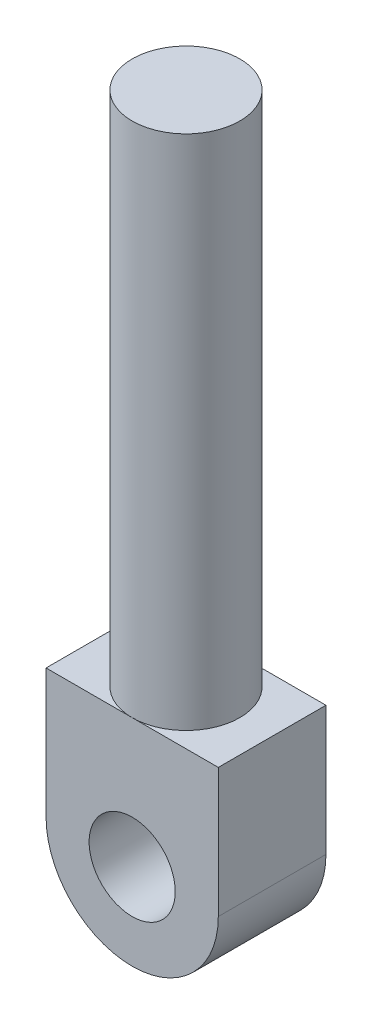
ISO-10303-21;
HEADER;
FILE_DESCRIPTION(('STEP AP214'),'2;1');
FILE_NAME('part.step','',(''),(''),'','','');
FILE_SCHEMA(('AUTOMOTIVE_DESIGN { 1 0 10303 214 1 1 1 1 }'));
ENDSEC;
DATA;
#1=APPLICATION_CONTEXT('core data for automotive mechanical design processes');
#2=APPLICATION_PROTOCOL_DEFINITION('international standard','automotive_design',2000,#1);
#3=PRODUCT_CONTEXT('',#1,'mechanical');
#4=PRODUCT('Part','Part','',(#3));
#5=PRODUCT_RELATED_PRODUCT_CATEGORY('part','',(#4));
#6=PRODUCT_DEFINITION_FORMATION('','',#4);
#7=PRODUCT_DEFINITION_CONTEXT('part definition',#1,'design');
#8=PRODUCT_DEFINITION('design','',#6,#7);
#9=PRODUCT_DEFINITION_SHAPE('','',#8);
#10=(LENGTH_UNIT() NAMED_UNIT(*) SI_UNIT(.MILLI.,.METRE.));
#11=(NAMED_UNIT(*) PLANE_ANGLE_UNIT() SI_UNIT($,.RADIAN.));
#12=(NAMED_UNIT(*) SI_UNIT($,.STERADIAN.) SOLID_ANGLE_UNIT());
#13=UNCERTAINTY_MEASURE_WITH_UNIT(LENGTH_MEASURE(1.E-05),#10,'distance_accuracy_value','');
#14=(GEOMETRIC_REPRESENTATION_CONTEXT(3) GLOBAL_UNCERTAINTY_ASSIGNED_CONTEXT((#13)) GLOBAL_UNIT_ASSIGNED_CONTEXT((#10,
#11,#12)) REPRESENTATION_CONTEXT('',''));
#15=CARTESIAN_POINT('',(0.,0.,0.));
#16=DIRECTION('',(0.,0.,1.));
#17=DIRECTION('',(1.,0.,0.));
#18=AXIS2_PLACEMENT_3D('',#15,#16,#17);
#19=CARTESIAN_POINT('',(0.,60.,0.));
#20=DIRECTION('',(0.,-1.,0.));
#21=DIRECTION('',(0.,0.,-1.));
#22=AXIS2_PLACEMENT_3D('',#19,#20,#21);
#23=CYLINDRICAL_SURFACE('',#22,6.25);
#24=CARTESIAN_POINT('',(0.,60.,0.));
#25=DIRECTION('',(0.,1.,0.));
#26=DIRECTION('',(0.,0.,1.));
#27=AXIS2_PLACEMENT_3D('',#24,#25,#26);
#28=CIRCLE('',#27,6.25);
#29=CARTESIAN_POINT('',(0.,60.,6.25));
#30=VERTEX_POINT('',#29);
#31=EDGE_CURVE('E129',#30,#30,#28,.T.);
#32=ORIENTED_EDGE('',*,*,#31,.F.);
#33=EDGE_LOOP('',(#32));
#34=FACE_BOUND('',#33,.T.);
#35=CARTESIAN_POINT('',(0.,0.,0.));
#36=DIRECTION('',(0.,1.,0.));
#37=DIRECTION('',(0.,0.,1.));
#38=AXIS2_PLACEMENT_3D('',#35,#36,#37);
#39=CIRCLE('',#38,6.25);
#40=CARTESIAN_POINT('',(0.,0.,6.25));
#41=VERTEX_POINT('',#40);
#42=CARTESIAN_POINT('',(0.,0.,-6.25));
#43=VERTEX_POINT('',#42);
#44=EDGE_CURVE('E133',#41,#43,#39,.T.);
#45=ORIENTED_EDGE('',*,*,#44,.T.);
#46=EDGE_CURVE('E109',#43,#41,#39,.T.);
#47=ORIENTED_EDGE('',*,*,#46,.T.);
#48=EDGE_LOOP('',(#45,#47));
#49=FACE_BOUND('',#48,.T.);
#50=ADVANCED_FACE('F41',(#34,#49),#23,.T.);
#51=CARTESIAN_POINT('',(0.,60.,0.));
#52=DIRECTION('',(0.,1.,0.));
#53=DIRECTION('',(0.,0.,1.));
#54=AXIS2_PLACEMENT_3D('',#51,#52,#53);
#55=PLANE('',#54);
#56=ORIENTED_EDGE('',*,*,#31,.T.);
#57=EDGE_LOOP('',(#56));
#58=FACE_BOUND('',#57,.T.);
#59=ADVANCED_FACE('F170',(#58),#55,.T.);
#60=CARTESIAN_POINT('',(0.,0.,6.25));
#61=DIRECTION('',(0.,-1.,0.));
#62=DIRECTION('',(1.,0.,0.));
#63=AXIS2_PLACEMENT_3D('',#60,#61,#62);
#64=PLANE('',#63);
#65=ORIENTED_EDGE('',*,*,#44,.F.);
#66=DIRECTION('',(-1.,0.,0.));
#67=VECTOR('',#66,1.);
#68=CARTESIAN_POINT('',(10.,0.,6.25));
#69=LINE('',#68,#67);
#70=CARTESIAN_POINT('',(10.,0.,6.25));
#71=VERTEX_POINT('',#70);
#72=EDGE_CURVE('E96',#71,#41,#69,.T.);
#73=ORIENTED_EDGE('',*,*,#72,.F.);
#74=DIRECTION('',(0.,0.,-1.));
#75=VECTOR('',#74,1.);
#76=CARTESIAN_POINT('',(10.,0.,6.25));
#77=LINE('',#76,#75);
#78=CARTESIAN_POINT('',(10.,0.,-6.25));
#79=VERTEX_POINT('',#78);
#80=EDGE_CURVE('E110',#71,#79,#77,.T.);
#81=ORIENTED_EDGE('',*,*,#80,.T.);
#82=DIRECTION('',(-1.,0.,0.));
#83=VECTOR('',#82,1.);
#84=CARTESIAN_POINT('',(0.,0.,-6.25));
#85=LINE('',#84,#83);
#86=EDGE_CURVE('E121',#79,#43,#85,.T.);
#87=ORIENTED_EDGE('',*,*,#86,.T.);
#88=EDGE_LOOP('',(#65,#73,#81,#87));
#89=FACE_BOUND('',#88,.T.);
#90=ADVANCED_FACE('F163',(#89),#64,.F.);
#91=CARTESIAN_POINT('',(0.,0.,6.25));
#92=DIRECTION('',(0.,0.,1.));
#93=DIRECTION('',(1.,0.,0.));
#94=AXIS2_PLACEMENT_3D('',#91,#92,#93);
#95=PLANE('',#94);
#96=DIRECTION('',(0.,-1.,0.));
#97=VECTOR('',#96,1.);
#98=CARTESIAN_POINT('',(-10.,0.,6.25));
#99=LINE('',#98,#97);
#100=CARTESIAN_POINT('',(-10.,0.,6.25));
#101=VERTEX_POINT('',#100);
#102=CARTESIAN_POINT('',(-10.,-15.,6.25));
#103=VERTEX_POINT('',#102);
#104=EDGE_CURVE('E94',#101,#103,#99,.T.);
#105=ORIENTED_EDGE('',*,*,#104,.T.);
#106=CARTESIAN_POINT('',(0.,-15.,6.25));
#107=DIRECTION('',(0.,0.,1.));
#108=DIRECTION('',(1.,0.,0.));
#109=AXIS2_PLACEMENT_3D('',#106,#107,#108);
#110=CIRCLE('',#109,10.);
#111=CARTESIAN_POINT('',(0.,-25.,6.25));
#112=VERTEX_POINT('',#111);
#113=EDGE_CURVE('E50',#103,#112,#110,.T.);
#114=ORIENTED_EDGE('',*,*,#113,.T.);
#115=CARTESIAN_POINT('',(0.,-15.,6.25));
#116=DIRECTION('',(0.,0.,1.));
#117=DIRECTION('',(1.,0.,0.));
#118=AXIS2_PLACEMENT_3D('',#115,#116,#117);
#119=CIRCLE('',#118,10.);
#120=CARTESIAN_POINT('',(10.,-15.,6.25));
#121=VERTEX_POINT('',#120);
#122=EDGE_CURVE('E57',#112,#121,#119,.T.);
#123=ORIENTED_EDGE('',*,*,#122,.T.);
#124=DIRECTION('',(0.,1.,0.));
#125=VECTOR('',#124,1.);
#126=CARTESIAN_POINT('',(10.,-25.,6.25));
#127=LINE('',#126,#125);
#128=EDGE_CURVE('E116',#121,#71,#127,.T.);
#129=ORIENTED_EDGE('',*,*,#128,.T.);
#130=ORIENTED_EDGE('',*,*,#72,.T.);
#131=EDGE_CURVE('E89',#41,#101,#69,.T.);
#132=ORIENTED_EDGE('',*,*,#131,.T.);
#133=EDGE_LOOP('',(#105,#114,#123,#129,#130,#132));
#134=FACE_BOUND('',#133,.T.);
#135=CARTESIAN_POINT('',(0.,-15.,6.25));
#136=DIRECTION('',(0.,0.,1.));
#137=DIRECTION('',(1.,0.,0.));
#138=AXIS2_PLACEMENT_3D('',#135,#136,#137);
#139=CIRCLE('',#138,5.);
#140=CARTESIAN_POINT('',(5.,-15.,6.25));
#141=VERTEX_POINT('',#140);
#142=EDGE_CURVE('E154',#141,#141,#139,.T.);
#143=ORIENTED_EDGE('',*,*,#142,.F.);
#144=EDGE_LOOP('',(#143));
#145=FACE_BOUND('',#144,.T.);
#146=ADVANCED_FACE('F91',(#134,#145),#95,.T.);
#147=CARTESIAN_POINT('',(0.,0.,-6.25));
#148=DIRECTION('',(0.,0.,1.));
#149=DIRECTION('',(1.,0.,0.));
#150=AXIS2_PLACEMENT_3D('',#147,#148,#149);
#151=PLANE('',#150);
#152=CARTESIAN_POINT('',(0.,-15.,-6.25));
#153=DIRECTION('',(0.,0.,1.));
#154=DIRECTION('',(1.,0.,0.));
#155=AXIS2_PLACEMENT_3D('',#152,#153,#154);
#156=CIRCLE('',#155,10.);
#157=CARTESIAN_POINT('',(10.,-15.,-6.25));
#158=VERTEX_POINT('',#157);
#159=CARTESIAN_POINT('',(0.,-25.,-6.25));
#160=VERTEX_POINT('',#159);
#161=EDGE_CURVE('E132',#158,#160,#156,.F.);
#162=ORIENTED_EDGE('',*,*,#161,.T.);
#163=CARTESIAN_POINT('',(0.,-15.,-6.25));
#164=DIRECTION('',(0.,0.,1.));
#165=DIRECTION('',(1.,0.,0.));
#166=AXIS2_PLACEMENT_3D('',#163,#164,#165);
#167=CIRCLE('',#166,10.);
#168=CARTESIAN_POINT('',(-10.,-15.,-6.25));
#169=VERTEX_POINT('',#168);
#170=EDGE_CURVE('E137',#160,#169,#167,.F.);
#171=ORIENTED_EDGE('',*,*,#170,.T.);
#172=DIRECTION('',(0.,-1.,0.));
#173=VECTOR('',#172,1.);
#174=CARTESIAN_POINT('',(-10.,0.,-6.25));
#175=LINE('',#174,#173);
#176=CARTESIAN_POINT('',(-10.,0.,-6.25));
#177=VERTEX_POINT('',#176);
#178=EDGE_CURVE('E124',#177,#169,#175,.T.);
#179=ORIENTED_EDGE('',*,*,#178,.F.);
#180=EDGE_CURVE('E105',#43,#177,#85,.T.);
#181=ORIENTED_EDGE('',*,*,#180,.F.);
#182=ORIENTED_EDGE('',*,*,#86,.F.);
#183=DIRECTION('',(0.,1.,0.));
#184=VECTOR('',#183,1.);
#185=CARTESIAN_POINT('',(10.,-25.,-6.25));
#186=LINE('',#185,#184);
#187=EDGE_CURVE('E99',#158,#79,#186,.T.);
#188=ORIENTED_EDGE('',*,*,#187,.F.);
#189=EDGE_LOOP('',(#162,#171,#179,#181,#182,#188));
#190=FACE_BOUND('',#189,.T.);
#191=CARTESIAN_POINT('',(0.,-15.,-6.25));
#192=DIRECTION('',(0.,0.,1.));
#193=DIRECTION('',(1.,0.,0.));
#194=AXIS2_PLACEMENT_3D('',#191,#192,#193);
#195=CIRCLE('',#194,5.);
#196=CARTESIAN_POINT('',(5.,-15.,-6.25));
#197=VERTEX_POINT('',#196);
#198=EDGE_CURVE('E152',#197,#197,#195,.T.);
#199=ORIENTED_EDGE('',*,*,#198,.T.);
#200=EDGE_LOOP('',(#199));
#201=FACE_BOUND('',#200,.T.);
#202=ADVANCED_FACE('F143',(#190,#201),#151,.F.);
#203=ORIENTED_EDGE('',*,*,#46,.F.);
#204=ORIENTED_EDGE('',*,*,#180,.T.);
#205=DIRECTION('',(0.,0.,-1.));
#206=VECTOR('',#205,1.);
#207=CARTESIAN_POINT('',(-10.,0.,6.25));
#208=LINE('',#207,#206);
#209=EDGE_CURVE('E102',#101,#177,#208,.T.);
#210=ORIENTED_EDGE('',*,*,#209,.F.);
#211=ORIENTED_EDGE('',*,*,#131,.F.);
#212=EDGE_LOOP('',(#203,#204,#210,#211));
#213=FACE_BOUND('',#212,.T.);
#214=ADVANCED_FACE('F103',(#213),#64,.F.);
#215=CARTESIAN_POINT('',(-10.,0.,6.25));
#216=DIRECTION('',(1.,0.,0.));
#217=DIRECTION('',(0.,1.,0.));
#218=AXIS2_PLACEMENT_3D('',#215,#216,#217);
#219=PLANE('',#218);
#220=ORIENTED_EDGE('',*,*,#178,.T.);
#221=DIRECTION('',(0.,0.,-1.));
#222=VECTOR('',#221,1.);
#223=CARTESIAN_POINT('',(-10.,-15.,6.25));
#224=LINE('',#223,#222);
#225=EDGE_CURVE('E115',#169,#103,#224,.F.);
#226=ORIENTED_EDGE('',*,*,#225,.T.);
#227=ORIENTED_EDGE('',*,*,#104,.F.);
#228=ORIENTED_EDGE('',*,*,#209,.T.);
#229=EDGE_LOOP('',(#220,#226,#227,#228));
#230=FACE_BOUND('',#229,.T.);
#231=ADVANCED_FACE('F113',(#230),#219,.F.);
#232=CARTESIAN_POINT('',(10.,-25.,6.25));
#233=DIRECTION('',(-1.,0.,0.));
#234=DIRECTION('',(0.,-1.,0.));
#235=AXIS2_PLACEMENT_3D('',#232,#233,#234);
#236=PLANE('',#235);
#237=ORIENTED_EDGE('',*,*,#128,.F.);
#238=DIRECTION('',(0.,0.,-1.));
#239=VECTOR('',#238,1.);
#240=CARTESIAN_POINT('',(10.,-15.,6.25));
#241=LINE('',#240,#239);
#242=EDGE_CURVE('E11',#121,#158,#241,.T.);
#243=ORIENTED_EDGE('',*,*,#242,.T.);
#244=ORIENTED_EDGE('',*,*,#187,.T.);
#245=ORIENTED_EDGE('',*,*,#80,.F.);
#246=EDGE_LOOP('',(#237,#243,#244,#245));
#247=FACE_BOUND('',#246,.T.);
#248=ADVANCED_FACE('F191',(#247),#236,.F.);
#249=CARTESIAN_POINT('',(0.,-15.,6.25));
#250=DIRECTION('',(0.,0.,-1.));
#251=DIRECTION('',(-1.,0.,0.));
#252=AXIS2_PLACEMENT_3D('',#249,#250,#251);
#253=CYLINDRICAL_SURFACE('',#252,5.);
#254=ORIENTED_EDGE('',*,*,#142,.T.);
#255=EDGE_LOOP('',(#254));
#256=FACE_BOUND('',#255,.T.);
#257=ORIENTED_EDGE('',*,*,#198,.F.);
#258=EDGE_LOOP('',(#257));
#259=FACE_BOUND('',#258,.T.);
#260=ADVANCED_FACE('F160',(#256,#259),#253,.F.);
#261=CARTESIAN_POINT('',(0.,-15.,6.25));
#262=DIRECTION('',(0.,0.,-1.));
#263=DIRECTION('',(-1.,0.,0.));
#264=AXIS2_PLACEMENT_3D('',#261,#262,#263);
#265=CYLINDRICAL_SURFACE('',#264,10.);
#266=ORIENTED_EDGE('',*,*,#242,.F.);
#267=ORIENTED_EDGE('',*,*,#122,.F.);
#268=DIRECTION('',(0.,0.,-1.));
#269=VECTOR('',#268,1.);
#270=CARTESIAN_POINT('',(0.,-25.,6.25));
#271=LINE('',#270,#269);
#272=EDGE_CURVE('E45',#160,#112,#271,.F.);
#273=ORIENTED_EDGE('',*,*,#272,.F.);
#274=ORIENTED_EDGE('',*,*,#161,.F.);
#275=EDGE_LOOP('',(#266,#267,#273,#274));
#276=FACE_BOUND('',#275,.T.);
#277=ADVANCED_FACE('F43',(#276),#265,.T.);
#278=CARTESIAN_POINT('',(0.,-15.,6.25));
#279=DIRECTION('',(0.,0.,-1.));
#280=DIRECTION('',(-1.,0.,0.));
#281=AXIS2_PLACEMENT_3D('',#278,#279,#280);
#282=CYLINDRICAL_SURFACE('',#281,10.);
#283=ORIENTED_EDGE('',*,*,#113,.F.);
#284=ORIENTED_EDGE('',*,*,#225,.F.);
#285=ORIENTED_EDGE('',*,*,#170,.F.);
#286=ORIENTED_EDGE('',*,*,#272,.T.);
#287=EDGE_LOOP('',(#283,#284,#285,#286));
#288=FACE_BOUND('',#287,.T.);
#289=ADVANCED_FACE('F150',(#288),#282,.T.);
#290=CLOSED_SHELL('',(#50,#59,#90,#146,#202,#214,#231,#248,#260,#277,#289));
#291=MANIFOLD_SOLID_BREP('B2',#290);
#292=ADVANCED_BREP_SHAPE_REPRESENTATION('',(#18,#291),#14);
#293=SHAPE_DEFINITION_REPRESENTATION(#9,#292);
ENDSEC;
END-ISO-10303-21;
